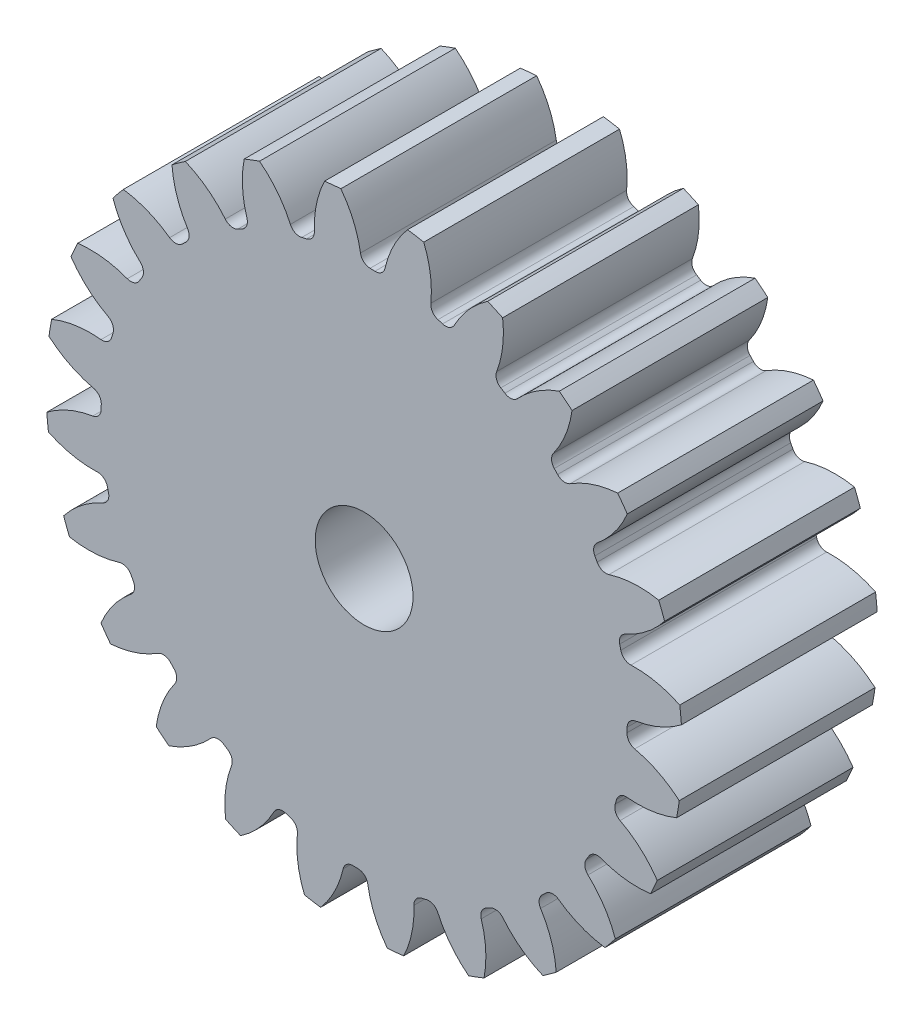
from build123d import *

# Parameters (mm, degrees)
SKETCH3_R         = 165.1
GEARBODY_DEPTH    = 101.6
TOOTHCUT_DEPTH    = 255.634208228
CIRPATTERN1_COUNT = 24
BOREDIA_R         = 25.4
BORE_DEPTH        = 12700


with BuildPart() as part:
    # Sketch3 → gearBody (new body)
    with BuildSketch(Plane.XY):
        Circle(SKETCH3_R)
    extrude(amount=GEARBODY_DEPTH)

    # Sketch2 → toothCut (cut, through all)
    with BuildSketch(Plane.XY):
        with BuildLine():
            ThreePointArc((136.409315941, -5.619087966), (136.455375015, -4.359616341), (136.489805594, -3.099773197))
            ThreePointArc((136.489805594, -3.099773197), (137.760713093, 0.178978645), (140.835074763, 1.885940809))
            ThreePointArc((140.835074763, 1.885940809), (153.626462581, 5.625207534), (165.1, 12.404562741))
            ThreePointArc((165.1, 12.404562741), (165.480909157, -5.28695389), (163.971476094, -22.918075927))
            ThreePointArc((163.971476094, -22.918075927), (152.954083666, -15.420157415), (140.427470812, -10.872005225))
            ThreePointArc((140.427470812, -10.872005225), (137.468339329, -8.972278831), (136.409315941, -5.619087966))
        make_face()
    toothcut = extrude(amount=TOOTHCUT_DEPTH, mode=Mode.SUBTRACT)

    # CirPattern1: toothCut ×24 about axis
    cirpattern1_axis = Axis((0, 0, 0), (0, 0, 1))
    for i in range(1, CIRPATTERN1_COUNT):
        add(toothcut.rotate(cirpattern1_axis, i * 360 / CIRPATTERN1_COUNT), mode=Mode.SUBTRACT)

    # boreDia → bore (cut, symmetric)
    with BuildSketch(Plane.XY):
        Circle(BOREDIA_R)
    extrude(amount=BORE_DEPTH, both=True, mode=Mode.SUBTRACT)


solid = part.part
